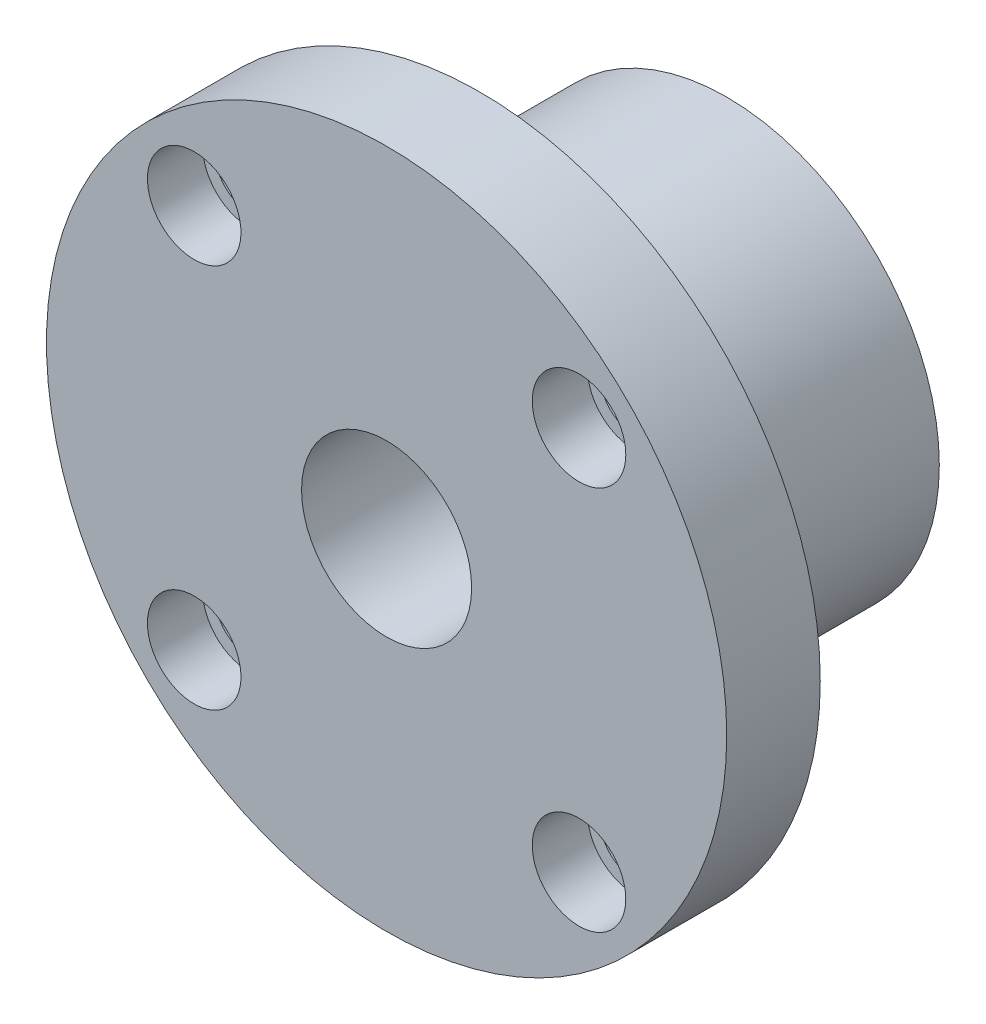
ISO-10303-21;
HEADER;
FILE_DESCRIPTION(('STEP AP214'),'2;1');
FILE_NAME('part.step','',(''),(''),'','','');
FILE_SCHEMA(('AUTOMOTIVE_DESIGN { 1 0 10303 214 1 1 1 1 }'));
ENDSEC;
DATA;
#1=APPLICATION_CONTEXT('core data for automotive mechanical design processes');
#2=APPLICATION_PROTOCOL_DEFINITION('international standard','automotive_design',2000,#1);
#3=PRODUCT_CONTEXT('',#1,'mechanical');
#4=PRODUCT('Part','Part','',(#3));
#5=PRODUCT_RELATED_PRODUCT_CATEGORY('part','',(#4));
#6=PRODUCT_DEFINITION_FORMATION('','',#4);
#7=PRODUCT_DEFINITION_CONTEXT('part definition',#1,'design');
#8=PRODUCT_DEFINITION('design','',#6,#7);
#9=PRODUCT_DEFINITION_SHAPE('','',#8);
#10=(LENGTH_UNIT() NAMED_UNIT(*) SI_UNIT(.MILLI.,.METRE.));
#11=(NAMED_UNIT(*) PLANE_ANGLE_UNIT() SI_UNIT($,.RADIAN.));
#12=(NAMED_UNIT(*) SI_UNIT($,.STERADIAN.) SOLID_ANGLE_UNIT());
#13=UNCERTAINTY_MEASURE_WITH_UNIT(LENGTH_MEASURE(1.E-05),#10,'distance_accuracy_value','');
#14=(GEOMETRIC_REPRESENTATION_CONTEXT(3) GLOBAL_UNCERTAINTY_ASSIGNED_CONTEXT((#13)) GLOBAL_UNIT_ASSIGNED_CONTEXT((#10,
#11,#12)) REPRESENTATION_CONTEXT('',''));
#15=CARTESIAN_POINT('',(0.,0.,0.));
#16=DIRECTION('',(0.,0.,1.));
#17=DIRECTION('',(1.,0.,0.));
#18=AXIS2_PLACEMENT_3D('',#15,#16,#17);
#19=CARTESIAN_POINT('',(0.,0.,0.));
#20=DIRECTION('',(0.,0.,1.));
#21=DIRECTION('',(1.,0.,0.));
#22=AXIS2_PLACEMENT_3D('',#19,#20,#21);
#23=PLANE('',#22);
#24=CARTESIAN_POINT('',(0.,0.,0.));
#25=DIRECTION('',(0.,0.,1.));
#26=DIRECTION('',(1.,0.,0.));
#27=AXIS2_PLACEMENT_3D('',#24,#25,#26);
#28=CIRCLE('',#27,40.);
#29=CARTESIAN_POINT('',(40.,0.,0.));
#30=VERTEX_POINT('',#29);
#31=EDGE_CURVE('E23',#30,#30,#28,.T.);
#32=ORIENTED_EDGE('',*,*,#31,.F.);
#33=EDGE_LOOP('',(#32));
#34=FACE_BOUND('',#33,.T.);
#35=CARTESIAN_POINT('',(22.6274169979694,22.6274169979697,0.));
#36=DIRECTION('',(0.,0.,1.));
#37=DIRECTION('',(1.,0.,0.));
#38=AXIS2_PLACEMENT_3D('',#35,#36,#37);
#39=CIRCLE('',#38,4.);
#40=CARTESIAN_POINT('',(26.6274169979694,22.6274169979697,0.));
#41=VERTEX_POINT('',#40);
#42=EDGE_CURVE('E35',#41,#41,#39,.T.);
#43=ORIENTED_EDGE('',*,*,#42,.T.);
#44=EDGE_LOOP('',(#43));
#45=FACE_BOUND('',#44,.T.);
#46=CARTESIAN_POINT('',(22.6274169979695,-22.6274169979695,0.));
#47=DIRECTION('',(0.,0.,1.));
#48=DIRECTION('',(0.,-1.,0.));
#49=AXIS2_PLACEMENT_3D('',#46,#47,#48);
#50=CIRCLE('',#49,4.);
#51=CARTESIAN_POINT('',(22.6274169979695,-26.6274169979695,0.));
#52=VERTEX_POINT('',#51);
#53=EDGE_CURVE('E75',#52,#52,#50,.T.);
#54=ORIENTED_EDGE('',*,*,#53,.T.);
#55=EDGE_LOOP('',(#54));
#56=FACE_BOUND('',#55,.T.);
#57=CARTESIAN_POINT('',(-22.6274169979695,-22.6274169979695,0.));
#58=DIRECTION('',(0.,0.,1.));
#59=DIRECTION('',(-1.,0.,0.));
#60=AXIS2_PLACEMENT_3D('',#57,#58,#59);
#61=CIRCLE('',#60,4.);
#62=CARTESIAN_POINT('',(-26.6274169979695,-22.6274169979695,0.));
#63=VERTEX_POINT('',#62);
#64=EDGE_CURVE('E72',#63,#63,#61,.T.);
#65=ORIENTED_EDGE('',*,*,#64,.T.);
#66=EDGE_LOOP('',(#65));
#67=FACE_BOUND('',#66,.T.);
#68=CARTESIAN_POINT('',(-22.6274169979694,22.6274169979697,0.));
#69=DIRECTION('',(0.,0.,1.));
#70=DIRECTION('',(0.,1.,0.));
#71=AXIS2_PLACEMENT_3D('',#68,#69,#70);
#72=CIRCLE('',#71,4.);
#73=CARTESIAN_POINT('',(-22.6274169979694,26.6274169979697,0.));
#74=VERTEX_POINT('',#73);
#75=EDGE_CURVE('E40',#74,#74,#72,.T.);
#76=ORIENTED_EDGE('',*,*,#75,.T.);
#77=EDGE_LOOP('',(#76));
#78=FACE_BOUND('',#77,.T.);
#79=CARTESIAN_POINT('',(0.,0.,0.));
#80=DIRECTION('',(0.,0.,1.));
#81=DIRECTION('',(1.,0.,0.));
#82=AXIS2_PLACEMENT_3D('',#79,#80,#81);
#83=CIRCLE('',#82,25.);
#84=CARTESIAN_POINT('',(25.,0.,0.));
#85=VERTEX_POINT('',#84);
#86=EDGE_CURVE('E8',#85,#85,#83,.F.);
#87=ORIENTED_EDGE('',*,*,#86,.F.);
#88=EDGE_LOOP('',(#87));
#89=FACE_BOUND('',#88,.T.);
#90=ADVANCED_FACE('F12',(#34,#45,#56,#67,#78,#89),#23,.F.);
#91=CARTESIAN_POINT('',(-22.6274169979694,22.6274169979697,0.));
#92=DIRECTION('',(0.,0.,1.));
#93=DIRECTION('',(1.,0.,0.));
#94=AXIS2_PLACEMENT_3D('',#91,#92,#93);
#95=CYLINDRICAL_SURFACE('',#94,4.);
#96=ORIENTED_EDGE('',*,*,#75,.F.);
#97=EDGE_LOOP('',(#96));
#98=FACE_BOUND('',#97,.T.);
#99=CARTESIAN_POINT('',(-22.6274169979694,22.6274169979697,4.5));
#100=DIRECTION('',(0.,0.,1.));
#101=DIRECTION('',(1.,0.,0.));
#102=AXIS2_PLACEMENT_3D('',#99,#100,#101);
#103=CIRCLE('',#102,4.);
#104=CARTESIAN_POINT('',(-18.6274169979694,22.6274169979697,4.5));
#105=VERTEX_POINT('',#104);
#106=EDGE_CURVE('E46',#105,#105,#103,.F.);
#107=ORIENTED_EDGE('',*,*,#106,.F.);
#108=EDGE_LOOP('',(#107));
#109=FACE_BOUND('',#108,.T.);
#110=ADVANCED_FACE('F120',(#98,#109),#95,.F.);
#111=CARTESIAN_POINT('',(-22.6274169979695,-22.6274169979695,0.));
#112=DIRECTION('',(0.,0.,1.));
#113=DIRECTION('',(1.,0.,0.));
#114=AXIS2_PLACEMENT_3D('',#111,#112,#113);
#115=CYLINDRICAL_SURFACE('',#114,4.);
#116=ORIENTED_EDGE('',*,*,#64,.F.);
#117=EDGE_LOOP('',(#116));
#118=FACE_BOUND('',#117,.T.);
#119=CARTESIAN_POINT('',(-22.6274169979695,-22.6274169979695,4.5));
#120=DIRECTION('',(0.,0.,1.));
#121=DIRECTION('',(1.,0.,0.));
#122=AXIS2_PLACEMENT_3D('',#119,#120,#121);
#123=CIRCLE('',#122,4.);
#124=CARTESIAN_POINT('',(-18.6274169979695,-22.6274169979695,4.5));
#125=VERTEX_POINT('',#124);
#126=EDGE_CURVE('E42',#125,#125,#123,.F.);
#127=ORIENTED_EDGE('',*,*,#126,.F.);
#128=EDGE_LOOP('',(#127));
#129=FACE_BOUND('',#128,.T.);
#130=ADVANCED_FACE('F126',(#118,#129),#115,.F.);
#131=CARTESIAN_POINT('',(22.6274169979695,-22.6274169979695,0.));
#132=DIRECTION('',(0.,0.,1.));
#133=DIRECTION('',(1.,0.,0.));
#134=AXIS2_PLACEMENT_3D('',#131,#132,#133);
#135=CYLINDRICAL_SURFACE('',#134,4.);
#136=ORIENTED_EDGE('',*,*,#53,.F.);
#137=EDGE_LOOP('',(#136));
#138=FACE_BOUND('',#137,.T.);
#139=CARTESIAN_POINT('',(22.6274169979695,-22.6274169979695,4.5));
#140=DIRECTION('',(0.,0.,1.));
#141=DIRECTION('',(1.,0.,0.));
#142=AXIS2_PLACEMENT_3D('',#139,#140,#141);
#143=CIRCLE('',#142,4.);
#144=CARTESIAN_POINT('',(26.6274169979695,-22.6274169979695,4.5));
#145=VERTEX_POINT('',#144);
#146=EDGE_CURVE('E37',#145,#145,#143,.F.);
#147=ORIENTED_EDGE('',*,*,#146,.F.);
#148=EDGE_LOOP('',(#147));
#149=FACE_BOUND('',#148,.T.);
#150=ADVANCED_FACE('F137',(#138,#149),#135,.F.);
#151=CARTESIAN_POINT('',(22.6274169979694,22.6274169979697,0.));
#152=DIRECTION('',(0.,0.,1.));
#153=DIRECTION('',(1.,0.,0.));
#154=AXIS2_PLACEMENT_3D('',#151,#152,#153);
#155=CYLINDRICAL_SURFACE('',#154,4.);
#156=ORIENTED_EDGE('',*,*,#42,.F.);
#157=EDGE_LOOP('',(#156));
#158=FACE_BOUND('',#157,.T.);
#159=CARTESIAN_POINT('',(22.6274169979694,22.6274169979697,4.5));
#160=DIRECTION('',(0.,0.,1.));
#161=DIRECTION('',(1.,0.,0.));
#162=AXIS2_PLACEMENT_3D('',#159,#160,#161);
#163=CIRCLE('',#162,4.);
#164=CARTESIAN_POINT('',(26.6274169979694,22.6274169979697,4.5));
#165=VERTEX_POINT('',#164);
#166=EDGE_CURVE('E32',#165,#165,#163,.F.);
#167=ORIENTED_EDGE('',*,*,#166,.F.);
#168=EDGE_LOOP('',(#167));
#169=FACE_BOUND('',#168,.T.);
#170=ADVANCED_FACE('F92',(#158,#169),#155,.F.);
#171=CARTESIAN_POINT('',(0.,0.,11.));
#172=DIRECTION('',(0.,0.,1.));
#173=DIRECTION('',(1.,0.,0.));
#174=AXIS2_PLACEMENT_3D('',#171,#172,#173);
#175=PLANE('',#174);
#176=CARTESIAN_POINT('',(0.,0.,11.));
#177=DIRECTION('',(0.,0.,1.));
#178=DIRECTION('',(1.,0.,0.));
#179=AXIS2_PLACEMENT_3D('',#176,#177,#178);
#180=CIRCLE('',#179,10.);
#181=CARTESIAN_POINT('',(10.,0.,11.));
#182=VERTEX_POINT('',#181);
#183=EDGE_CURVE('E28',#182,#182,#180,.T.);
#184=ORIENTED_EDGE('',*,*,#183,.F.);
#185=EDGE_LOOP('',(#184));
#186=FACE_BOUND('',#185,.T.);
#187=CARTESIAN_POINT('',(0.,0.,11.));
#188=DIRECTION('',(0.,0.,1.));
#189=DIRECTION('',(1.,0.,0.));
#190=AXIS2_PLACEMENT_3D('',#187,#188,#189);
#191=CIRCLE('',#190,40.);
#192=CARTESIAN_POINT('',(40.,0.,11.));
#193=VERTEX_POINT('',#192);
#194=EDGE_CURVE('E19',#193,#193,#191,.T.);
#195=ORIENTED_EDGE('',*,*,#194,.T.);
#196=EDGE_LOOP('',(#195));
#197=FACE_BOUND('',#196,.T.);
#198=CARTESIAN_POINT('',(22.6274169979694,22.6274169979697,11.));
#199=DIRECTION('',(0.,0.,1.));
#200=DIRECTION('',(1.,0.,0.));
#201=AXIS2_PLACEMENT_3D('',#198,#199,#200);
#202=CIRCLE('',#201,5.5);
#203=CARTESIAN_POINT('',(28.1274169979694,22.6274169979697,11.));
#204=VERTEX_POINT('',#203);
#205=EDGE_CURVE('E78',#204,#204,#202,.T.);
#206=ORIENTED_EDGE('',*,*,#205,.F.);
#207=EDGE_LOOP('',(#206));
#208=FACE_BOUND('',#207,.T.);
#209=CARTESIAN_POINT('',(22.6274169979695,-22.6274169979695,11.));
#210=DIRECTION('',(0.,0.,1.));
#211=DIRECTION('',(0.,-1.,0.));
#212=AXIS2_PLACEMENT_3D('',#209,#210,#211);
#213=CIRCLE('',#212,5.5);
#214=CARTESIAN_POINT('',(22.6274169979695,-28.1274169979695,11.));
#215=VERTEX_POINT('',#214);
#216=EDGE_CURVE('E44',#215,#215,#213,.T.);
#217=ORIENTED_EDGE('',*,*,#216,.F.);
#218=EDGE_LOOP('',(#217));
#219=FACE_BOUND('',#218,.T.);
#220=CARTESIAN_POINT('',(-22.6274169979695,-22.6274169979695,11.));
#221=DIRECTION('',(0.,0.,1.));
#222=DIRECTION('',(-1.,0.,0.));
#223=AXIS2_PLACEMENT_3D('',#220,#221,#222);
#224=CIRCLE('',#223,5.5);
#225=CARTESIAN_POINT('',(-28.1274169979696,-22.6274169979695,11.));
#226=VERTEX_POINT('',#225);
#227=EDGE_CURVE('E48',#226,#226,#224,.T.);
#228=ORIENTED_EDGE('',*,*,#227,.F.);
#229=EDGE_LOOP('',(#228));
#230=FACE_BOUND('',#229,.T.);
#231=CARTESIAN_POINT('',(-22.6274169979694,22.6274169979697,11.));
#232=DIRECTION('',(0.,0.,1.));
#233=DIRECTION('',(0.,1.,0.));
#234=AXIS2_PLACEMENT_3D('',#231,#232,#233);
#235=CIRCLE('',#234,5.5);
#236=CARTESIAN_POINT('',(-22.6274169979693,28.1274169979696,11.));
#237=VERTEX_POINT('',#236);
#238=EDGE_CURVE('E55',#237,#237,#235,.T.);
#239=ORIENTED_EDGE('',*,*,#238,.F.);
#240=EDGE_LOOP('',(#239));
#241=FACE_BOUND('',#240,.T.);
#242=ADVANCED_FACE('F90',(#186,#197,#208,#219,#230,#241),#175,.T.);
#243=CARTESIAN_POINT('',(0.,0.,11.));
#244=DIRECTION('',(0.,0.,-1.));
#245=DIRECTION('',(-1.,0.,0.));
#246=AXIS2_PLACEMENT_3D('',#243,#244,#245);
#247=CYLINDRICAL_SURFACE('',#246,40.);
#248=ORIENTED_EDGE('',*,*,#194,.F.);
#249=EDGE_LOOP('',(#248));
#250=FACE_BOUND('',#249,.T.);
#251=ORIENTED_EDGE('',*,*,#31,.T.);
#252=EDGE_LOOP('',(#251));
#253=FACE_BOUND('',#252,.T.);
#254=ADVANCED_FACE('F14',(#250,#253),#247,.T.);
#255=CARTESIAN_POINT('',(0.,0.,11.));
#256=DIRECTION('',(0.,0.,-1.));
#257=DIRECTION('',(-1.,0.,0.));
#258=AXIS2_PLACEMENT_3D('',#255,#256,#257);
#259=CYLINDRICAL_SURFACE('',#258,10.);
#260=ORIENTED_EDGE('',*,*,#183,.T.);
#261=EDGE_LOOP('',(#260));
#262=FACE_BOUND('',#261,.T.);
#263=CARTESIAN_POINT('',(0.,0.,-29.));
#264=DIRECTION('',(0.,0.,-1.));
#265=DIRECTION('',(-1.,0.,0.));
#266=AXIS2_PLACEMENT_3D('',#263,#264,#265);
#267=CIRCLE('',#266,10.);
#268=CARTESIAN_POINT('',(-10.,0.,-29.));
#269=VERTEX_POINT('',#268);
#270=EDGE_CURVE('E292',#269,#269,#267,.T.);
#271=ORIENTED_EDGE('',*,*,#270,.T.);
#272=EDGE_LOOP('',(#271));
#273=FACE_BOUND('',#272,.T.);
#274=ADVANCED_FACE('F87',(#262,#273),#259,.F.);
#275=CARTESIAN_POINT('',(22.6274169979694,22.6274169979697,4.5));
#276=DIRECTION('',(0.,0.,1.));
#277=DIRECTION('',(1.,0.,0.));
#278=AXIS2_PLACEMENT_3D('',#275,#276,#277);
#279=PLANE('',#278);
#280=CARTESIAN_POINT('',(22.6274169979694,22.6274169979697,4.5));
#281=DIRECTION('',(0.,0.,1.));
#282=DIRECTION('',(1.,0.,0.));
#283=AXIS2_PLACEMENT_3D('',#280,#281,#282);
#284=CIRCLE('',#283,5.5);
#285=CARTESIAN_POINT('',(28.1274169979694,22.6274169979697,4.5));
#286=VERTEX_POINT('',#285);
#287=EDGE_CURVE('E36',#286,#286,#284,.T.);
#288=ORIENTED_EDGE('',*,*,#287,.T.);
#289=EDGE_LOOP('',(#288));
#290=FACE_BOUND('',#289,.T.);
#291=ORIENTED_EDGE('',*,*,#166,.T.);
#292=EDGE_LOOP('',(#291));
#293=FACE_BOUND('',#292,.T.);
#294=ADVANCED_FACE('F134',(#290,#293),#279,.T.);
#295=CARTESIAN_POINT('',(22.6274169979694,22.6274169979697,4.5));
#296=DIRECTION('',(0.,0.,1.));
#297=DIRECTION('',(1.,0.,0.));
#298=AXIS2_PLACEMENT_3D('',#295,#296,#297);
#299=CYLINDRICAL_SURFACE('',#298,5.5);
#300=ORIENTED_EDGE('',*,*,#287,.F.);
#301=EDGE_LOOP('',(#300));
#302=FACE_BOUND('',#301,.T.);
#303=ORIENTED_EDGE('',*,*,#205,.T.);
#304=EDGE_LOOP('',(#303));
#305=FACE_BOUND('',#304,.T.);
#306=ADVANCED_FACE('F139',(#302,#305),#299,.F.);
#307=CARTESIAN_POINT('',(22.6274169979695,-22.6274169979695,4.5));
#308=DIRECTION('',(0.,0.,1.));
#309=DIRECTION('',(0.,-1.,0.));
#310=AXIS2_PLACEMENT_3D('',#307,#308,#309);
#311=PLANE('',#310);
#312=CARTESIAN_POINT('',(22.6274169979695,-22.6274169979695,4.5));
#313=DIRECTION('',(0.,0.,1.));
#314=DIRECTION('',(0.,-1.,0.));
#315=AXIS2_PLACEMENT_3D('',#312,#313,#314);
#316=CIRCLE('',#315,5.5);
#317=CARTESIAN_POINT('',(22.6274169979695,-28.1274169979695,4.5));
#318=VERTEX_POINT('',#317);
#319=EDGE_CURVE('E41',#318,#318,#316,.T.);
#320=ORIENTED_EDGE('',*,*,#319,.T.);
#321=EDGE_LOOP('',(#320));
#322=FACE_BOUND('',#321,.T.);
#323=ORIENTED_EDGE('',*,*,#146,.T.);
#324=EDGE_LOOP('',(#323));
#325=FACE_BOUND('',#324,.T.);
#326=ADVANCED_FACE('F142',(#322,#325),#311,.T.);
#327=CARTESIAN_POINT('',(22.6274169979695,-22.6274169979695,4.5));
#328=DIRECTION('',(0.,0.,1.));
#329=DIRECTION('',(1.,0.,0.));
#330=AXIS2_PLACEMENT_3D('',#327,#328,#329);
#331=CYLINDRICAL_SURFACE('',#330,5.5);
#332=ORIENTED_EDGE('',*,*,#319,.F.);
#333=EDGE_LOOP('',(#332));
#334=FACE_BOUND('',#333,.T.);
#335=ORIENTED_EDGE('',*,*,#216,.T.);
#336=EDGE_LOOP('',(#335));
#337=FACE_BOUND('',#336,.T.);
#338=ADVANCED_FACE('F153',(#334,#337),#331,.F.);
#339=CARTESIAN_POINT('',(-22.6274169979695,-22.6274169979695,4.5));
#340=DIRECTION('',(0.,0.,1.));
#341=DIRECTION('',(-1.,0.,0.));
#342=AXIS2_PLACEMENT_3D('',#339,#340,#341);
#343=PLANE('',#342);
#344=CARTESIAN_POINT('',(-22.6274169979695,-22.6274169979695,4.5));
#345=DIRECTION('',(0.,0.,1.));
#346=DIRECTION('',(-1.,0.,0.));
#347=AXIS2_PLACEMENT_3D('',#344,#345,#346);
#348=CIRCLE('',#347,5.5);
#349=CARTESIAN_POINT('',(-28.1274169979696,-22.6274169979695,4.5));
#350=VERTEX_POINT('',#349);
#351=EDGE_CURVE('E45',#350,#350,#348,.T.);
#352=ORIENTED_EDGE('',*,*,#351,.T.);
#353=EDGE_LOOP('',(#352));
#354=FACE_BOUND('',#353,.T.);
#355=ORIENTED_EDGE('',*,*,#126,.T.);
#356=EDGE_LOOP('',(#355));
#357=FACE_BOUND('',#356,.T.);
#358=ADVANCED_FACE('F156',(#354,#357),#343,.T.);
#359=CARTESIAN_POINT('',(-22.6274169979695,-22.6274169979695,4.5));
#360=DIRECTION('',(0.,0.,1.));
#361=DIRECTION('',(1.,0.,0.));
#362=AXIS2_PLACEMENT_3D('',#359,#360,#361);
#363=CYLINDRICAL_SURFACE('',#362,5.5);
#364=ORIENTED_EDGE('',*,*,#351,.F.);
#365=EDGE_LOOP('',(#364));
#366=FACE_BOUND('',#365,.T.);
#367=ORIENTED_EDGE('',*,*,#227,.T.);
#368=EDGE_LOOP('',(#367));
#369=FACE_BOUND('',#368,.T.);
#370=ADVANCED_FACE('F116',(#366,#369),#363,.F.);
#371=CARTESIAN_POINT('',(-22.6274169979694,22.6274169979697,4.5));
#372=DIRECTION('',(0.,0.,1.));
#373=DIRECTION('',(0.,1.,0.));
#374=AXIS2_PLACEMENT_3D('',#371,#372,#373);
#375=PLANE('',#374);
#376=CARTESIAN_POINT('',(-22.6274169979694,22.6274169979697,4.5));
#377=DIRECTION('',(0.,0.,1.));
#378=DIRECTION('',(0.,1.,0.));
#379=AXIS2_PLACEMENT_3D('',#376,#377,#378);
#380=CIRCLE('',#379,5.5);
#381=CARTESIAN_POINT('',(-22.6274169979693,28.1274169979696,4.5));
#382=VERTEX_POINT('',#381);
#383=EDGE_CURVE('E49',#382,#382,#380,.T.);
#384=ORIENTED_EDGE('',*,*,#383,.T.);
#385=EDGE_LOOP('',(#384));
#386=FACE_BOUND('',#385,.T.);
#387=ORIENTED_EDGE('',*,*,#106,.T.);
#388=EDGE_LOOP('',(#387));
#389=FACE_BOUND('',#388,.T.);
#390=ADVANCED_FACE('F105',(#386,#389),#375,.T.);
#391=CARTESIAN_POINT('',(-22.6274169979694,22.6274169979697,4.5));
#392=DIRECTION('',(0.,0.,1.));
#393=DIRECTION('',(1.,0.,0.));
#394=AXIS2_PLACEMENT_3D('',#391,#392,#393);
#395=CYLINDRICAL_SURFACE('',#394,5.5);
#396=ORIENTED_EDGE('',*,*,#383,.F.);
#397=EDGE_LOOP('',(#396));
#398=FACE_BOUND('',#397,.T.);
#399=ORIENTED_EDGE('',*,*,#238,.T.);
#400=EDGE_LOOP('',(#399));
#401=FACE_BOUND('',#400,.T.);
#402=ADVANCED_FACE('F102',(#398,#401),#395,.F.);
#403=CARTESIAN_POINT('',(0.,0.,-29.));
#404=DIRECTION('',(0.,0.,1.));
#405=DIRECTION('',(1.,0.,0.));
#406=AXIS2_PLACEMENT_3D('',#403,#404,#405);
#407=CYLINDRICAL_SURFACE('',#406,25.);
#408=CARTESIAN_POINT('',(0.,0.,-29.));
#409=DIRECTION('',(0.,0.,-1.));
#410=DIRECTION('',(-1.,0.,0.));
#411=AXIS2_PLACEMENT_3D('',#408,#409,#410);
#412=CIRCLE('',#411,25.);
#413=CARTESIAN_POINT('',(-25.,0.,-29.));
#414=VERTEX_POINT('',#413);
#415=EDGE_CURVE('E60',#414,#414,#412,.T.);
#416=ORIENTED_EDGE('',*,*,#415,.F.);
#417=EDGE_LOOP('',(#416));
#418=FACE_BOUND('',#417,.T.);
#419=ORIENTED_EDGE('',*,*,#86,.T.);
#420=EDGE_LOOP('',(#419));
#421=FACE_BOUND('',#420,.T.);
#422=ADVANCED_FACE('F104',(#418,#421),#407,.T.);
#423=CARTESIAN_POINT('',(0.,0.,-29.));
#424=DIRECTION('',(0.,0.,-1.));
#425=DIRECTION('',(-1.,0.,0.));
#426=AXIS2_PLACEMENT_3D('',#423,#424,#425);
#427=PLANE('',#426);
#428=ORIENTED_EDGE('',*,*,#415,.T.);
#429=EDGE_LOOP('',(#428));
#430=FACE_BOUND('',#429,.T.);
#431=ORIENTED_EDGE('',*,*,#270,.F.);
#432=EDGE_LOOP('',(#431));
#433=FACE_BOUND('',#432,.T.);
#434=ADVANCED_FACE('F113',(#430,#433),#427,.T.);
#435=CLOSED_SHELL('',(#90,#110,#130,#150,#170,#242,#254,#274,#294,#306,#326,#338,#358,#370,#390,
#402,#422,#434));
#436=MANIFOLD_SOLID_BREP('B1',#435);
#437=ADVANCED_BREP_SHAPE_REPRESENTATION('',(#18,#436),#14);
#438=SHAPE_DEFINITION_REPRESENTATION(#9,#437);
ENDSEC;
END-ISO-10303-21;
